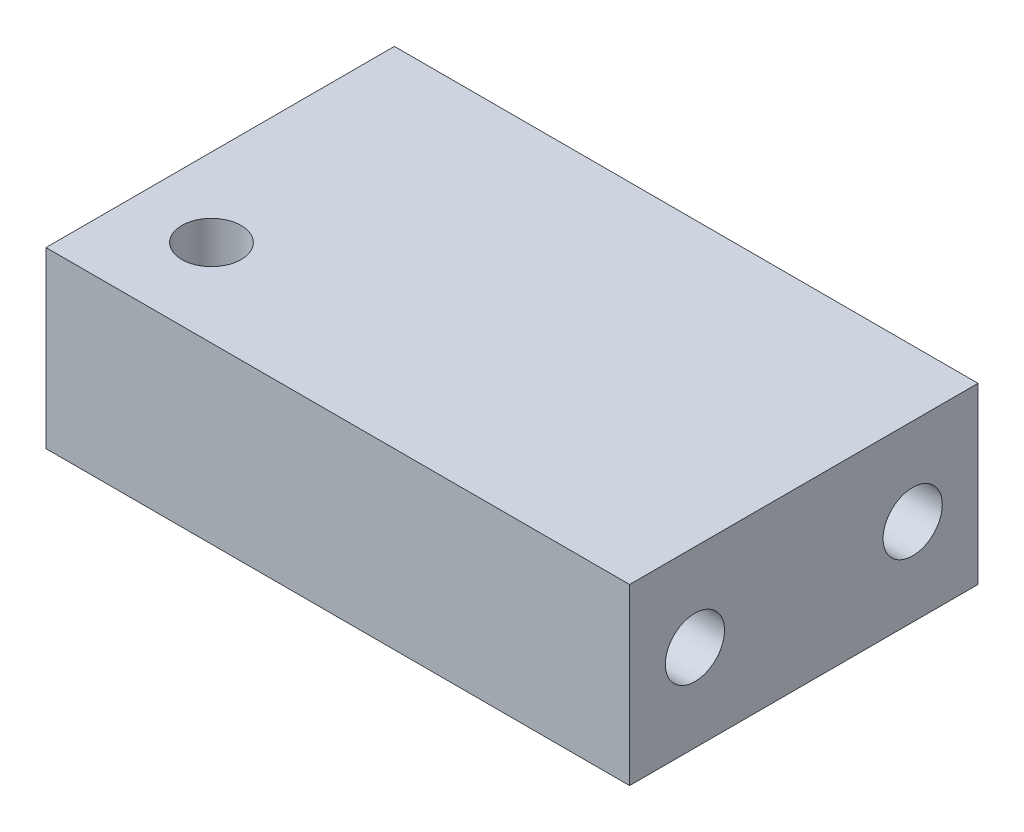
from build123d import *

# Parameters (mm, degrees)
ESQUISSE1_W                = 67
ESQUISSE1_H                = 20
BASE_EXTRUSION_DEPTH       = 40
TROU_TARAUD_M8X1_251_D     = 6.8
TROU_TARAUD_M8X1_251_DEPTH = 26.25
TROU_TARAUD_M8X1_251_TIP   = 2.042926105
TROU_TARAUD_M8X1_252_D     = 6.8
TROU_TARAUD_M8X1_252_DEPTH = 36.25
TROU_TARAUD_M8X1_252_TIP   = 2.042926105


with BuildPart() as part:
    # Esquisse1 → Base-Extrusion (new body)
    with BuildSketch(Plane.XY):
        with Locations((44.247922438, -17.809833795)):
            Rectangle(ESQUISSE1_W, ESQUISSE1_H)
    extrude(amount=BASE_EXTRUSION_DEPTH)

    # Trou taraud_ M8x1.251
    with Locations(Plane(origin=(0, -7.809833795, 0), x_dir=(-1, 0, 0), z_dir=(0, 1, 0))):
        with Locations((-19.747922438, 30)):
            Hole(TROU_TARAUD_M8X1_251_D / 2, depth=TROU_TARAUD_M8X1_251_DEPTH)
            with Locations((0, 0, -(TROU_TARAUD_M8X1_251_DEPTH + TROU_TARAUD_M8X1_251_TIP / 2))):  # 118° drill point
                Cone(0, TROU_TARAUD_M8X1_251_D / 2, TROU_TARAUD_M8X1_251_TIP, mode=Mode.SUBTRACT)

    # Trou taraud_ M8x1.252
    with Locations(Plane(origin=(77.747922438, 0, 0), x_dir=(0, 0, -1), z_dir=(1, 0, 0))):
        with Locations((-7.5, -17.809833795), (-32.5, -17.809833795)):
            Hole(TROU_TARAUD_M8X1_252_D / 2, depth=TROU_TARAUD_M8X1_252_DEPTH)
            with Locations((0, 0, -(TROU_TARAUD_M8X1_252_DEPTH + TROU_TARAUD_M8X1_252_TIP / 2))):  # 118° drill point
                Cone(0, TROU_TARAUD_M8X1_252_D / 2, TROU_TARAUD_M8X1_252_TIP, mode=Mode.SUBTRACT)


solid = part.part
